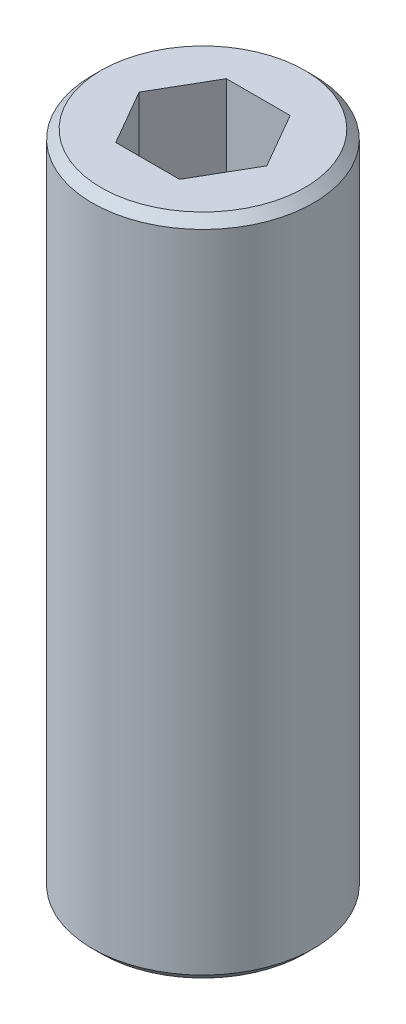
from build123d import *

# Parameters (mm, degrees)
CUT_EXTRUDE1_DEPTH = 2.54


with BuildPart() as part:
    # Sketch2 → Revolve1 (revolve)
    with BuildSketch(Plane.XY):
        Polygon((0, 0), (-2.921, 0), (-3.175, -0.254), (-3.175, -18.796), (-2.921, -19.05), (0, -18.794445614), align=None)
    revolve(axis=Axis((0, 0, 0), (0, -1, 0)))

    # Sketch3 → Cut-Extrude1 (cut)
    with BuildSketch(Plane(origin=(0, 0, 0), x_dir=(1, 0, 0), z_dir=(0, 1, 0))):
        Polygon((-0.916543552, -1.5875), (0.916543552, -1.5875), (1.833087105, 0), (0.916543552, 1.5875), (-0.916543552, 1.5875), (-1.833087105, 0), align=None)
    extrude(amount=-CUT_EXTRUDE1_DEPTH, mode=Mode.SUBTRACT)


solid = part.part
